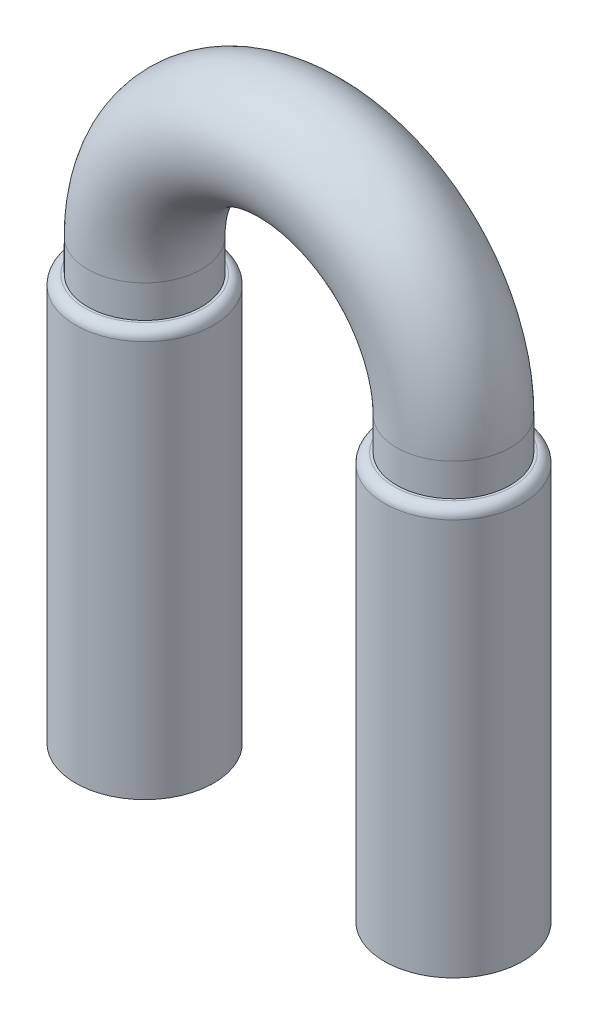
from build123d import *

# Parameters (mm, degrees)
ESQUISSE2_R        = 3.5
ESQUISSE3_R        = 4.25
BOSS_EXTRU_1_DEPTH = 25
CONG_1_R           = 0.6


with BuildPart() as part:
    # Balayage1: sweep along a path in Esquisse1
    with BuildLine(Plane.XY) as balayage1_path:
        Line((0, 0), (0, 27))
        ThreePointArc((0, 27), (9.5, 36.5), (19, 27))
        Line((19, 27), (19, 0))
    # Esquisse2 → Balayage1 (sweep)
    with BuildSketch(Plane(origin=(0, 0, 0), x_dir=(1, 0, 0), z_dir=(0, 1, 0))):
        Circle(ESQUISSE2_R)
    sweep(path=balayage1_path.line)

    # Esquisse3 → Boss.-Extru.1 (add)
    with BuildSketch(Plane.XZ):
        with Locations(Location((19, 0, 0), (0, 0, 270))):
            Circle(ESQUISSE3_R)
        with Locations(Location((0, 0, 0), (0, 0, 270))):
            Circle(ESQUISSE3_R)
    extrude(amount=-BOSS_EXTRU_1_DEPTH)

    # Cong_1
    cong_1_edges = [part.edges().sort_by_distance(p)[0] for p in [
        (19, 25, 4.25),
        (0, 25, 4.25),
    ]]
    fillet(cong_1_edges, radius=CONG_1_R)


solid = part.part
